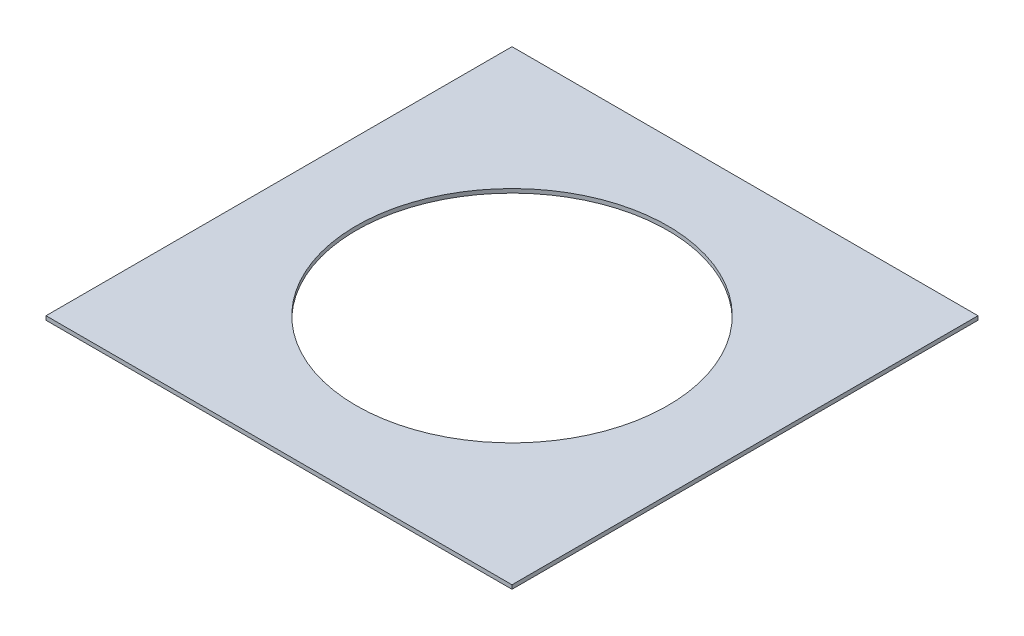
from build123d import *

# Parameters (mm, degrees)
SKETCH1_W           = 186.944
SKETCH1_H           = 186.944
SKETCH1_R           = 62.484
BOSS_EXTRUDE1_DEPTH = 1.5875


with BuildPart() as part:
    # Sketch1 → Boss-Extrude1 (new body)
    with BuildSketch(Plane(origin=(0, 0, 0), x_dir=(1, 0, 0), z_dir=(0, 1, 0))):
        Rectangle(SKETCH1_W, SKETCH1_H)
        with Locations(Location((0, 0, 0), (0, 0, 270))):
            Circle(SKETCH1_R, mode=Mode.SUBTRACT)
    extrude(amount=BOSS_EXTRUDE1_DEPTH)


solid = part.part
